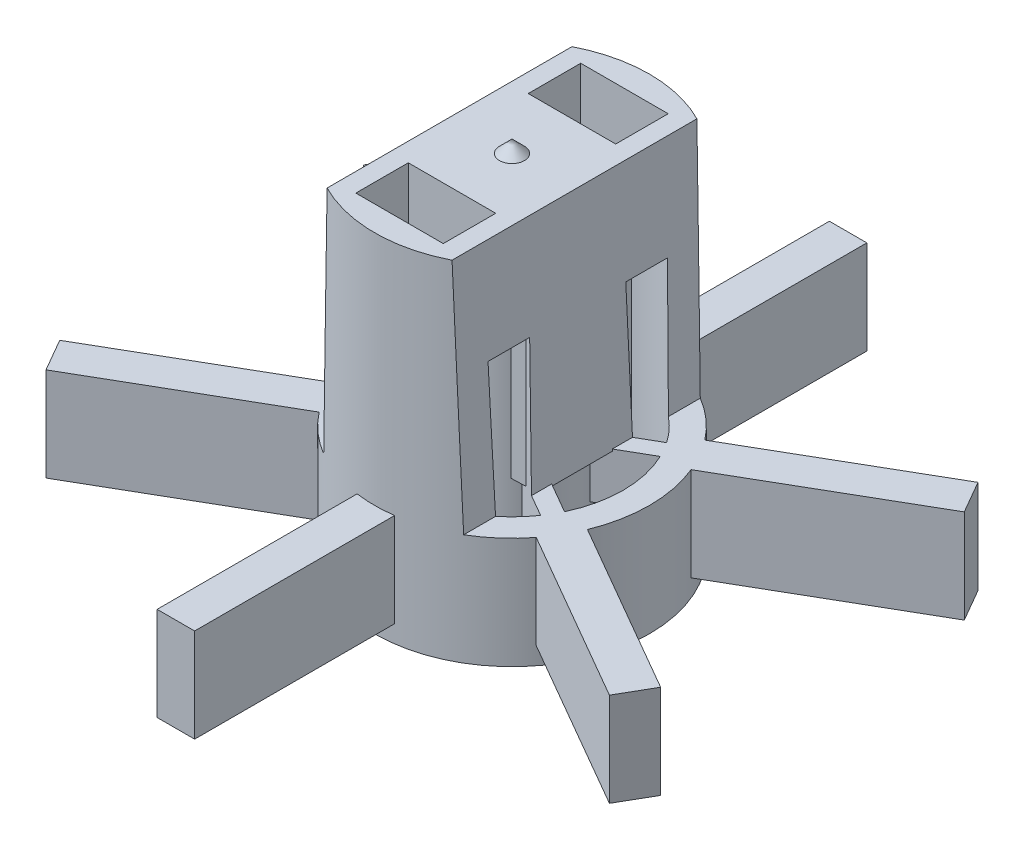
from build123d import *

# Parameters (mm, degrees)
ESQUISSE3_W                  = 0.7
ESQUISSE3_H                  = 2.75
EXTRUSION1_DEPTH             = 7.3
R_P_TITION_CIRCULAIRE1_COUNT = 6
ENL_V_MAT_EXTRU_1_DEPTH      = 10
EXTRUSION2_REACH             = 21.626
EXTRUSION2_END_RADIUS        = 2.4
ESQUISSE4_W                  = 3.393242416
ESQUISSE4_H                  = 5.804289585
ESQUISSE5_W                  = 3.5
ESQUISSE5_H                  = 2.1
ENL_V_MAT_EXTRU_2_DEPTH      = 3.75
EXTRUSION3_DEPTH             = 3.75
R_P_TITION_CIRCULAIRE2_COUNT = 6


with BuildPart() as part:
    # Esquisse1 → R_volution1 (revolve)
    with BuildSketch(Plane.XY, mode=Mode.PRIVATE) as r_volution1_sk:
        Polygon((1.55, 2.5), (1.55, 14.3), (0, 15.85), (0, 16.9), (0.5, 16.4), (5.5, 16.4), (5.5, 2.5), (4.45, 2.5), (4.45, 12.3), (2.4, 12.3), (2.4, 2.5), align=None)
    revolve(r_volution1_sk.sketch.rotate(Axis((0, 0, 0), (0, 1, 0)), 90), axis=Axis((0, 0, 0), (0, 1, 0)))

    # Esquisse3 → Extrusion1 (add)
    with BuildSketch(Plane.XZ.offset(-12.3)):
        with Locations((0, 3.375)):
            Rectangle(ESQUISSE3_W, ESQUISSE3_H)
    extrusion1 = extrude(amount=EXTRUSION1_DEPTH)

    # R_p_tition circulaire1: Extrusion1 ×6 about axis
    r_p_tition_circulaire1_axis = Axis((0, 0, 0), (0, 1, 0))
    for i in range(1, R_P_TITION_CIRCULAIRE1_COUNT):
        add(extrusion1.rotate(r_p_tition_circulaire1_axis, i * 360 / R_P_TITION_CIRCULAIRE1_COUNT))

    # Esquisse2 → Enl_v. mat.-Extru.1 (cut, symmetric)
    with BuildSketch(Plane.XY):
        Polygon((2.5, 16.4), (2.8, 6.95), (7.364841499, 6.95), (7.364841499, 16.4), align=None)
        Polygon((-7.364841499, 16.4), (-2.5, 16.4), (-2.8, 6.95), (-7.364841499, 6.95), align=None)
    extrude(amount=ENL_V_MAT_EXTRU_1_DEPTH, both=True, mode=Mode.SUBTRACT)

    # Extrusion2: up to this cylinder (the profile starts outside it)
    extrusion2_end = Plane(origin=(0, 9.773756, 0), z_dir=(0, -1, 0)) * Cylinder(EXTRUSION2_END_RADIUS, 49.052, mode=Mode.PRIVATE)
    # Esquisse4 → Extrusion2 (add, up to the surface)
    with BuildSketch(Plane(origin=(3.017593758, 0.095796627, 0), x_dir=(0, 0, -1), z_dir=(0.9994964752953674, 0.031730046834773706, 0)), mode=Mode.PRIVATE) as extrusion2_sk1:
        with Locations((-0.018736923, 9.682834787)):
            Rectangle(ESQUISSE4_W, ESQUISSE4_H)
    extrusion2_tool1 = extrude(extrusion2_sk1.sketch, amount=-EXTRUSION2_REACH, mode=Mode.PRIVATE) - extrusion2_end
    extrusion2 = extrusion2_tool1.solids().sort_by_distance((2.710357, 9.773756, 0.018737))[0]
    add(extrusion2)

    # Sym_trie1: Extrusion2 across plane
    add(extrusion2.mirror(Plane(origin=(0, 0, 0), x_dir=(0, 0, 1), z_dir=(1, 0, 0))))

    # Esquisse5 → Enl_v. mat.-Extru.2 (cut)
    with BuildSketch(Plane(origin=(0, 16.4, 0), x_dir=(-1, 0, 0), z_dir=(0, 1, 0))):
        with Locations((0, -3.45)):
            Rectangle(ESQUISSE5_W, ESQUISSE5_H)
        with Locations((0, 3.45)):
            Rectangle(ESQUISSE5_W, ESQUISSE5_H)
    extrude(amount=-ENL_V_MAT_EXTRU_2_DEPTH, mode=Mode.SUBTRACT)

    # Esquisse6 → Extrusion3 (add)
    with BuildSketch(Plane(origin=(0, 6.95, 0), x_dir=(-1, 0, 0), z_dir=(0, 1, 0))):
        Polygon((-11.273041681, 7.374519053), (-4.044935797, 3.201370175), (-4.68380482, 1.83817057), (-12.023041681, 6.075480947), align=None)
    extrusion3 = extrude(amount=-EXTRUSION3_DEPTH)

    # R_p_tition circulaire2: Extrusion3 ×6 about axis
    r_p_tition_circulaire2_axis = Axis((0, 0, 0), (0, 1, 0))
    for i in range(1, R_P_TITION_CIRCULAIRE2_COUNT):
        add(extrusion3.rotate(r_p_tition_circulaire2_axis, i * 360 / R_P_TITION_CIRCULAIRE2_COUNT))


solid = part.part
